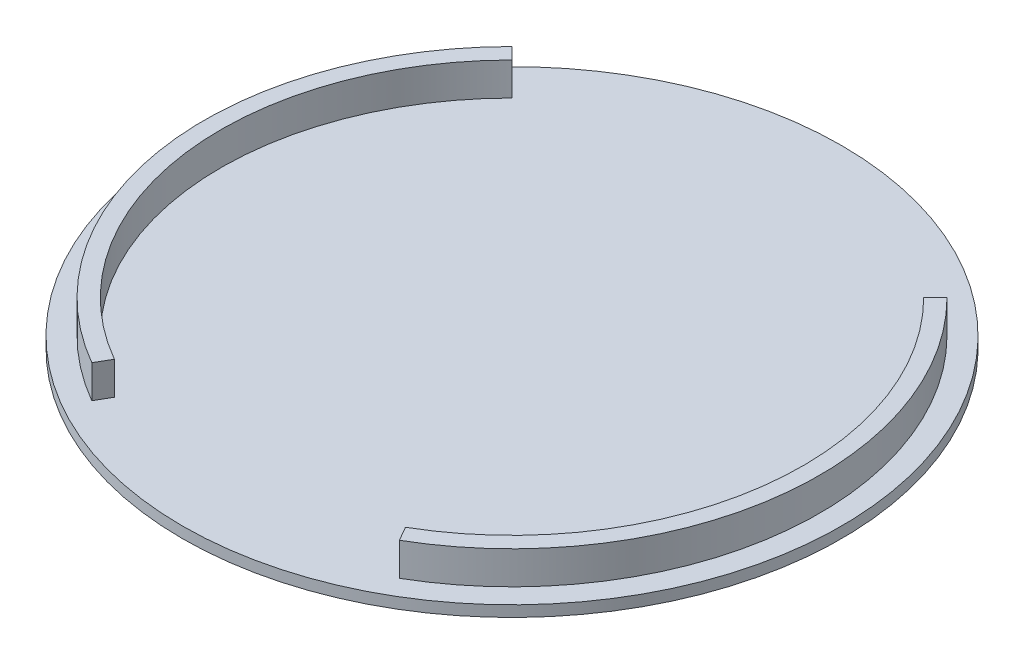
from build123d import *

# Parameters (mm, degrees)
ESQUISSE1_R             = 60
BOSS_EXTRU_1_DEPTH      = 2
BOSS_EXTRU_2_DEPTH      = 6
ESQUISSE3_W             = 10
ESQUISSE3_H             = 10
ENL_V_MAT_EXTRU_2_DEPTH = 1


with BuildPart() as part:
    # Esquisse1 → Boss.-Extru.1 (new body)
    with BuildSketch(Plane(origin=(0, 0, 0), x_dir=(1, 0, 0), z_dir=(0, 1, 0))):
        with Locations(Location((0, 0, 0), (0, 0, 270))):
            Circle(ESQUISSE1_R)
    extrude(amount=BOSS_EXTRU_1_DEPTH)

    # Esquisse2 → Boss.-Extru.2 (add)
    with BuildSketch(Plane(origin=(0, 2, 0), x_dir=(1, 0, 0), z_dir=(0, 1, 0))):
        with BuildLine():
            Line((-39.597979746, 39.597979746), (-37.476659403, 37.476659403))
            ThreePointArc((-37.476659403, 37.476659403), (-52.546577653, -6.917888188), (-26.5, -45.899346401))
            Line((-26.5, -45.899346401), (-28, -48.497422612))
            ThreePointArc((-28, -48.497422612), (-55.520912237, -7.309466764), (-39.597979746, 39.597979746))
        make_face()
        with BuildLine():
            Line((37.476659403, 37.476659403), (39.597979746, 39.597979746))
            ThreePointArc((39.597979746, 39.597979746), (55.520912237, -7.309466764), (28, -48.497422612))
            Line((28, -48.497422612), (26.5, -45.899346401))
            ThreePointArc((26.5, -45.899346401), (52.546577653, -6.917888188), (37.476659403, 37.476659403))
        make_face()
    extrude(amount=BOSS_EXTRU_2_DEPTH)

    # Esquisse3 → Enl_v. mat.-Extru.2 (cut)
    with BuildSketch(Plane.XZ):
        with Locations((-33, 33)):
            Rectangle(ESQUISSE3_W, ESQUISSE3_H)
        with Locations((33, 33)):
            Rectangle(ESQUISSE3_W, ESQUISSE3_H)
        with Locations((33, -33)):
            Rectangle(ESQUISSE3_W, ESQUISSE3_H)
        with Locations((-33, -33)):
            Rectangle(ESQUISSE3_W, ESQUISSE3_H)
    extrude(amount=-ENL_V_MAT_EXTRU_2_DEPTH, mode=Mode.SUBTRACT)


solid = part.part
